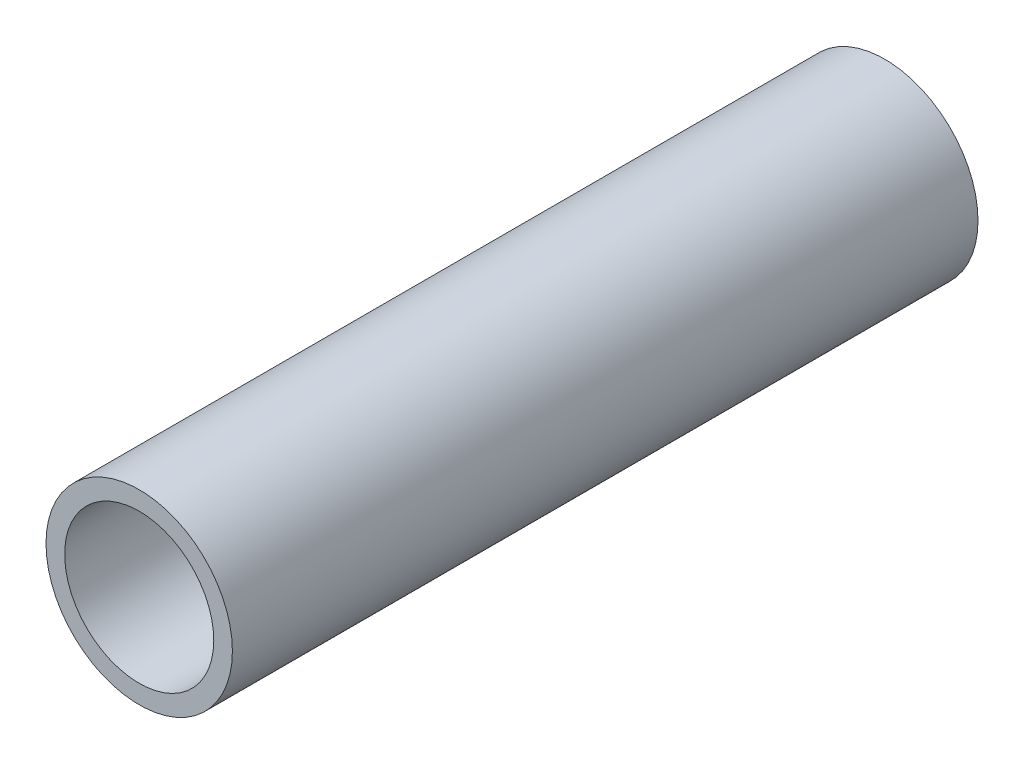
from build123d import *

# Parameters (mm, degrees)
ESQUISSE1_R      = 12.5
ESQUISSE1_R_2    = 10
EXTRUSION1_DEPTH = 100


with BuildPart() as part:
    # Esquisse1 → Extrusion1 (new body)
    with BuildSketch(Plane.XY):
        Circle(ESQUISSE1_R)
        Circle(ESQUISSE1_R_2, mode=Mode.SUBTRACT)
    extrude(amount=EXTRUSION1_DEPTH)


solid = part.part
